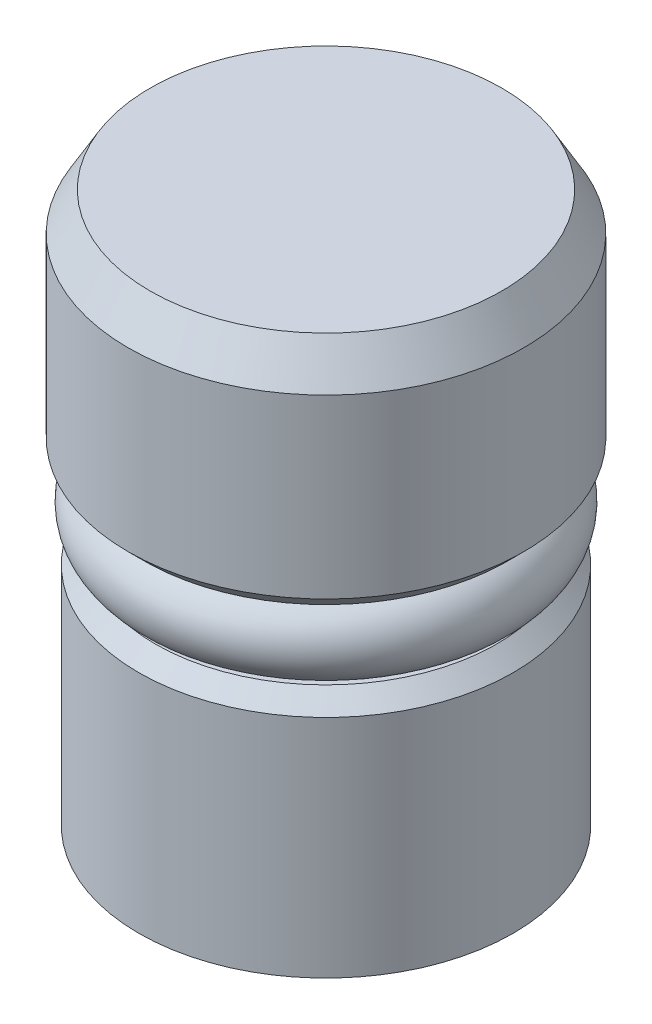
ISO-10303-21;
HEADER;
FILE_DESCRIPTION(('STEP AP214'),'2;1');
FILE_NAME('part.step','',(''),(''),'','','');
FILE_SCHEMA(('AUTOMOTIVE_DESIGN { 1 0 10303 214 1 1 1 1 }'));
ENDSEC;
DATA;
#1=APPLICATION_CONTEXT('core data for automotive mechanical design processes');
#2=APPLICATION_PROTOCOL_DEFINITION('international standard','automotive_design',2000,#1);
#3=PRODUCT_CONTEXT('',#1,'mechanical');
#4=PRODUCT('Part','Part','',(#3));
#5=PRODUCT_RELATED_PRODUCT_CATEGORY('part','',(#4));
#6=PRODUCT_DEFINITION_FORMATION('','',#4);
#7=PRODUCT_DEFINITION_CONTEXT('part definition',#1,'design');
#8=PRODUCT_DEFINITION('design','',#6,#7);
#9=PRODUCT_DEFINITION_SHAPE('','',#8);
#10=(LENGTH_UNIT() NAMED_UNIT(*) SI_UNIT(.MILLI.,.METRE.));
#11=(NAMED_UNIT(*) PLANE_ANGLE_UNIT() SI_UNIT($,.RADIAN.));
#12=(NAMED_UNIT(*) SI_UNIT($,.STERADIAN.) SOLID_ANGLE_UNIT());
#13=UNCERTAINTY_MEASURE_WITH_UNIT(LENGTH_MEASURE(1.E-05),#10,'distance_accuracy_value','');
#14=(GEOMETRIC_REPRESENTATION_CONTEXT(3) GLOBAL_UNCERTAINTY_ASSIGNED_CONTEXT((#13)) GLOBAL_UNIT_ASSIGNED_CONTEXT((#10,
#11,#12)) REPRESENTATION_CONTEXT('',''));
#15=CARTESIAN_POINT('',(0.,0.,0.));
#16=DIRECTION('',(0.,0.,1.));
#17=DIRECTION('',(1.,0.,0.));
#18=AXIS2_PLACEMENT_3D('',#15,#16,#17);
#19=CARTESIAN_POINT('',(0.,0.,0.));
#20=DIRECTION('',(0.,-1.,0.));
#21=DIRECTION('',(0.,0.,-1.));
#22=AXIS2_PLACEMENT_3D('',#19,#20,#21);
#23=PLANE('',#22);
#24=CARTESIAN_POINT('',(0.,0.,0.));
#25=DIRECTION('',(0.,-1.,0.));
#26=DIRECTION('',(0.,0.,-1.));
#27=AXIS2_PLACEMENT_3D('',#24,#25,#26);
#28=CIRCLE('',#27,3.9848917);
#29=CARTESIAN_POINT('',(0.,0.,-3.9848917));
#30=VERTEX_POINT('',#29);
#31=EDGE_CURVE('P0_E36',#30,#30,#28,.T.);
#32=ORIENTED_EDGE('',*,*,#31,.F.);
#33=EDGE_LOOP('',(#32));
#34=FACE_BOUND('',#33,.T.);
#35=CARTESIAN_POINT('',(0.,0.,0.));
#36=DIRECTION('',(0.,-1.,0.));
#37=DIRECTION('',(0.,0.,-1.));
#38=AXIS2_PLACEMENT_3D('',#35,#36,#37);
#39=CIRCLE('',#38,4.318);
#40=CARTESIAN_POINT('',(0.,0.,-4.318));
#41=VERTEX_POINT('',#40);
#42=EDGE_CURVE('P0_E56',#41,#41,#39,.T.);
#43=ORIENTED_EDGE('',*,*,#42,.T.);
#44=EDGE_LOOP('',(#43));
#45=FACE_BOUND('',#44,.T.);
#46=ADVANCED_FACE('P0_F16',(#34,#45),#23,.T.);
#47=CARTESIAN_POINT('',(0.,0.,0.));
#48=DIRECTION('',(0.,-1.,0.));
#49=DIRECTION('',(0.,0.,-1.));
#50=AXIS2_PLACEMENT_3D('',#47,#48,#49);
#51=CYLINDRICAL_SURFACE('',#50,4.318);
#52=CARTESIAN_POINT('',(0.,5.207,0.));
#53=DIRECTION('',(0.,1.,0.));
#54=DIRECTION('',(0.,0.,1.));
#55=AXIS2_PLACEMENT_3D('',#52,#53,#54);
#56=CIRCLE('',#55,4.318);
#57=CARTESIAN_POINT('',(0.,5.207,4.318));
#58=VERTEX_POINT('',#57);
#59=EDGE_CURVE('P0_E59',#58,#58,#56,.F.);
#60=ORIENTED_EDGE('',*,*,#59,.T.);
#61=EDGE_LOOP('',(#60));
#62=FACE_BOUND('',#61,.T.);
#63=ORIENTED_EDGE('',*,*,#42,.F.);
#64=EDGE_LOOP('',(#63));
#65=FACE_BOUND('',#64,.T.);
#66=ADVANCED_FACE('P0_F88',(#62,#65),#51,.T.);
#67=CARTESIAN_POINT('',(4.318,5.588,0.));
#68=DIRECTION('',(0.,1.,0.));
#69=DIRECTION('',(0.,0.,1.));
#70=AXIS2_PLACEMENT_3D('',#67,#68,#69);
#71=PLANE('',#70);
#72=CARTESIAN_POINT('',(0.,5.588,0.));
#73=DIRECTION('',(0.,1.,0.));
#74=DIRECTION('',(0.,0.,1.));
#75=AXIS2_PLACEMENT_3D('',#72,#73,#74);
#76=CIRCLE('',#75,3.937);
#77=CARTESIAN_POINT('',(0.,5.588,3.937));
#78=VERTEX_POINT('',#77);
#79=EDGE_CURVE('P0_E62',#78,#78,#76,.T.);
#80=ORIENTED_EDGE('',*,*,#79,.T.);
#81=EDGE_LOOP('',(#80));
#82=FACE_BOUND('',#81,.T.);
#83=CARTESIAN_POINT('',(0.,5.588,0.));
#84=DIRECTION('',(0.,-1.,0.));
#85=DIRECTION('',(0.,0.,-1.));
#86=AXIS2_PLACEMENT_3D('',#83,#84,#85);
#87=CIRCLE('',#86,2.54);
#88=CARTESIAN_POINT('',(0.,5.588,-2.54));
#89=VERTEX_POINT('',#88);
#90=EDGE_CURVE('P0_E53',#89,#89,#87,.T.);
#91=ORIENTED_EDGE('',*,*,#90,.T.);
#92=EDGE_LOOP('',(#91));
#93=FACE_BOUND('',#92,.T.);
#94=ADVANCED_FACE('P0_F95',(#82,#93),#71,.T.);
#95=CARTESIAN_POINT('',(0.,0.,0.));
#96=DIRECTION('',(0.,-1.,0.));
#97=DIRECTION('',(0.,0.,-1.));
#98=AXIS2_PLACEMENT_3D('',#95,#96,#97);
#99=CYLINDRICAL_SURFACE('',#98,2.54);
#100=CARTESIAN_POINT('',(0.,7.366,0.));
#101=DIRECTION('',(0.,-1.,0.));
#102=DIRECTION('',(0.,0.,-1.));
#103=AXIS2_PLACEMENT_3D('',#100,#101,#102);
#104=CIRCLE('',#103,2.54);
#105=CARTESIAN_POINT('',(0.,7.366,-2.54));
#106=VERTEX_POINT('',#105);
#107=EDGE_CURVE('P0_E50',#106,#106,#104,.T.);
#108=ORIENTED_EDGE('',*,*,#107,.T.);
#109=EDGE_LOOP('',(#108));
#110=FACE_BOUND('',#109,.T.);
#111=ORIENTED_EDGE('',*,*,#90,.F.);
#112=EDGE_LOOP('',(#111));
#113=FACE_BOUND('',#112,.T.);
#114=ADVANCED_FACE('P0_F117',(#110,#113),#99,.T.);
#115=CARTESIAN_POINT('',(2.54,7.366,0.));
#116=DIRECTION('',(0.,-1.,0.));
#117=DIRECTION('',(0.,0.,-1.));
#118=AXIS2_PLACEMENT_3D('',#115,#116,#117);
#119=PLANE('',#118);
#120=CARTESIAN_POINT('',(0.,7.366,0.));
#121=DIRECTION('',(0.,-1.,0.));
#122=DIRECTION('',(0.,0.,-1.));
#123=AXIS2_PLACEMENT_3D('',#120,#121,#122);
#124=CIRCLE('',#123,4.18306250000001);
#125=CARTESIAN_POINT('',(0.,7.366,-4.18306250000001));
#126=VERTEX_POINT('',#125);
#127=EDGE_CURVE('P0_E65',#126,#126,#124,.T.);
#128=ORIENTED_EDGE('',*,*,#127,.T.);
#129=EDGE_LOOP('',(#128));
#130=FACE_BOUND('',#129,.T.);
#131=ORIENTED_EDGE('',*,*,#107,.F.);
#132=EDGE_LOOP('',(#131));
#133=FACE_BOUND('',#132,.T.);
#134=ADVANCED_FACE('P0_F121',(#130,#133),#119,.T.);
#135=CARTESIAN_POINT('',(0.,0.,0.));
#136=DIRECTION('',(0.,-1.,0.));
#137=DIRECTION('',(0.,0.,-1.));
#138=AXIS2_PLACEMENT_3D('',#135,#136,#137);
#139=CYLINDRICAL_SURFACE('',#138,4.5640625);
#140=CARTESIAN_POINT('',(0.,11.820118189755,0.));
#141=DIRECTION('',(0.,1.,0.));
#142=DIRECTION('',(0.,0.,1.));
#143=AXIS2_PLACEMENT_3D('',#140,#141,#142);
#144=CIRCLE('',#143,4.5640625);
#145=CARTESIAN_POINT('',(0.,11.820118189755,4.5640625));
#146=VERTEX_POINT('',#145);
#147=EDGE_CURVE('P0_E23',#146,#146,#144,.F.);
#148=ORIENTED_EDGE('',*,*,#147,.T.);
#149=EDGE_LOOP('',(#148));
#150=FACE_BOUND('',#149,.T.);
#151=CARTESIAN_POINT('',(0.,7.747,0.));
#152=DIRECTION('',(0.,-1.,0.));
#153=DIRECTION('',(0.,0.,-1.));
#154=AXIS2_PLACEMENT_3D('',#151,#152,#153);
#155=CIRCLE('',#154,4.5640625);
#156=CARTESIAN_POINT('',(0.,7.747,-4.5640625));
#157=VERTEX_POINT('',#156);
#158=EDGE_CURVE('P0_E68',#157,#157,#155,.F.);
#159=ORIENTED_EDGE('',*,*,#158,.T.);
#160=EDGE_LOOP('',(#159));
#161=FACE_BOUND('',#160,.T.);
#162=ADVANCED_FACE('P0_F73',(#150,#161),#139,.T.);
#163=CARTESIAN_POINT('',(4.5640625,12.7,0.));
#164=DIRECTION('',(0.,1.,0.));
#165=DIRECTION('',(0.,0.,1.));
#166=AXIS2_PLACEMENT_3D('',#163,#164,#165);
#167=PLANE('',#166);
#168=CARTESIAN_POINT('',(0.,12.7,0.));
#169=DIRECTION('',(0.,1.,0.));
#170=DIRECTION('',(0.,0.,1.));
#171=AXIS2_PLACEMENT_3D('',#168,#169,#170);
#172=CIRCLE('',#171,4.05606249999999);
#173=CARTESIAN_POINT('',(0.,12.7,4.05606249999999));
#174=VERTEX_POINT('',#173);
#175=EDGE_CURVE('P0_E11',#174,#174,#172,.T.);
#176=ORIENTED_EDGE('',*,*,#175,.T.);
#177=EDGE_LOOP('',(#176));
#178=FACE_BOUND('',#177,.T.);
#179=ADVANCED_FACE('P0_F133',(#178),#167,.T.);
#180=CARTESIAN_POINT('',(0.,2.4892,0.));
#181=DIRECTION('',(0.,1.,0.));
#182=DIRECTION('',(0.,0.,1.));
#183=AXIS2_PLACEMENT_3D('',#180,#181,#182);
#184=PLANE('',#183);
#185=CARTESIAN_POINT('',(0.,2.4892,0.));
#186=DIRECTION('',(0.,-1.,0.));
#187=DIRECTION('',(0.,0.,-1.));
#188=AXIS2_PLACEMENT_3D('',#185,#186,#187);
#189=CIRCLE('',#188,1.35255);
#190=CARTESIAN_POINT('',(0.,2.4892,-1.35255));
#191=VERTEX_POINT('',#190);
#192=EDGE_CURVE('P0_E37',#191,#191,#189,.T.);
#193=ORIENTED_EDGE('',*,*,#192,.F.);
#194=EDGE_LOOP('',(#193));
#195=FACE_BOUND('',#194,.T.);
#196=CARTESIAN_POINT('',(0.,2.4892,0.));
#197=DIRECTION('',(0.,-1.,0.));
#198=DIRECTION('',(0.,0.,-1.));
#199=AXIS2_PLACEMENT_3D('',#196,#197,#198);
#200=CIRCLE('',#199,1.89865);
#201=CARTESIAN_POINT('',(0.,2.4892,-1.89865));
#202=VERTEX_POINT('',#201);
#203=EDGE_CURVE('P0_E47',#202,#202,#200,.T.);
#204=ORIENTED_EDGE('',*,*,#203,.T.);
#205=EDGE_LOOP('',(#204));
#206=FACE_BOUND('',#205,.T.);
#207=ADVANCED_FACE('P0_F136',(#195,#206),#184,.F.);
#208=CARTESIAN_POINT('',(0.,0.,0.));
#209=DIRECTION('',(0.,-1.,0.));
#210=DIRECTION('',(0.,0.,-1.));
#211=AXIS2_PLACEMENT_3D('',#208,#209,#210);
#212=CYLINDRICAL_SURFACE('',#211,1.89865);
#213=ORIENTED_EDGE('',*,*,#203,.F.);
#214=EDGE_LOOP('',(#213));
#215=FACE_BOUND('',#214,.T.);
#216=CARTESIAN_POINT('',(0.,2.39994654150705,0.));
#217=DIRECTION('',(0.,-1.,0.));
#218=DIRECTION('',(0.,0.,-1.));
#219=AXIS2_PLACEMENT_3D('',#216,#217,#218);
#220=CIRCLE('',#219,1.89865);
#221=CARTESIAN_POINT('',(0.,2.39994654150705,-1.89865));
#222=VERTEX_POINT('',#221);
#223=EDGE_CURVE('P0_E40',#222,#222,#220,.T.);
#224=ORIENTED_EDGE('',*,*,#223,.T.);
#225=EDGE_LOOP('',(#224));
#226=FACE_BOUND('',#225,.T.);
#227=ADVANCED_FACE('P0_F140',(#215,#226),#212,.F.);
#228=CARTESIAN_POINT('',(0.,0.,0.));
#229=DIRECTION('',(0.,-1.,0.));
#230=DIRECTION('',(0.,0.,-1.));
#231=AXIS2_PLACEMENT_3D('',#228,#229,#230);
#232=CONICAL_SURFACE('',#231,3.9848917,0.715584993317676);
#233=ORIENTED_EDGE('',*,*,#223,.F.);
#234=EDGE_LOOP('',(#233));
#235=FACE_BOUND('',#234,.T.);
#236=ORIENTED_EDGE('',*,*,#31,.T.);
#237=EDGE_LOOP('',(#236));
#238=FACE_BOUND('',#237,.T.);
#239=ADVANCED_FACE('P0_F30',(#235,#238),#232,.F.);
#240=CARTESIAN_POINT('',(0.,6.2992,0.));
#241=DIRECTION('',(0.,-1.,0.));
#242=DIRECTION('',(0.,0.,-1.));
#243=AXIS2_PLACEMENT_3D('',#240,#241,#242);
#244=CONICAL_SURFACE('',#243,1.35255,1.02974425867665);
#245=CARTESIAN_POINT('',(0.,7.11189403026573,0.));
#246=VERTEX_POINT('',#245);
#247=VERTEX_LOOP('',#246);
#248=FACE_BOUND('',#247,.T.);
#249=CARTESIAN_POINT('',(0.,6.2992,0.));
#250=DIRECTION('',(0.,-1.,0.));
#251=DIRECTION('',(0.,0.,-1.));
#252=AXIS2_PLACEMENT_3D('',#249,#250,#251);
#253=CIRCLE('',#252,1.35255);
#254=CARTESIAN_POINT('',(0.,6.2992,-1.35255));
#255=VERTEX_POINT('',#254);
#256=EDGE_CURVE('P0_E34',#255,#255,#253,.T.);
#257=ORIENTED_EDGE('',*,*,#256,.T.);
#258=EDGE_LOOP('',(#257));
#259=FACE_BOUND('',#258,.T.);
#260=ADVANCED_FACE('P0_F26',(#248,#259),#244,.F.);
#261=CARTESIAN_POINT('',(0.,2.4892,0.));
#262=DIRECTION('',(0.,-1.,0.));
#263=DIRECTION('',(0.,0.,-1.));
#264=AXIS2_PLACEMENT_3D('',#261,#262,#263);
#265=CYLINDRICAL_SURFACE('',#264,1.35255);
#266=ORIENTED_EDGE('',*,*,#256,.F.);
#267=EDGE_LOOP('',(#266));
#268=FACE_BOUND('',#267,.T.);
#269=ORIENTED_EDGE('',*,*,#192,.T.);
#270=EDGE_LOOP('',(#269));
#271=FACE_BOUND('',#270,.T.);
#272=ADVANCED_FACE('P0_F29',(#268,#271),#265,.F.);
#273=CARTESIAN_POINT('',(0.,5.207,0.));
#274=DIRECTION('',(0.,-1.,0.));
#275=DIRECTION('',(0.,0.,-1.));
#276=AXIS2_PLACEMENT_3D('',#273,#274,#275);
#277=CONICAL_SURFACE('',#276,4.318,0.785398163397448);
#278=ORIENTED_EDGE('',*,*,#79,.F.);
#279=EDGE_LOOP('',(#278));
#280=FACE_BOUND('',#279,.T.);
#281=ORIENTED_EDGE('',*,*,#59,.F.);
#282=EDGE_LOOP('',(#281));
#283=FACE_BOUND('',#282,.T.);
#284=ADVANCED_FACE('P0_F84',(#280,#283),#277,.T.);
#285=CARTESIAN_POINT('',(0.,7.366,0.));
#286=DIRECTION('',(0.,1.,0.));
#287=DIRECTION('',(0.,0.,1.));
#288=AXIS2_PLACEMENT_3D('',#285,#286,#287);
#289=CONICAL_SURFACE('',#288,4.18306250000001,0.785398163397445);
#290=ORIENTED_EDGE('',*,*,#158,.F.);
#291=EDGE_LOOP('',(#290));
#292=FACE_BOUND('',#291,.T.);
#293=ORIENTED_EDGE('',*,*,#127,.F.);
#294=EDGE_LOOP('',(#293));
#295=FACE_BOUND('',#294,.T.);
#296=ADVANCED_FACE('P0_F77',(#292,#295),#289,.T.);
#297=CARTESIAN_POINT('',(0.,11.820118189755,0.));
#298=DIRECTION('',(0.,-1.,0.));
#299=DIRECTION('',(0.,0.,-1.));
#300=AXIS2_PLACEMENT_3D('',#297,#298,#299);
#301=CONICAL_SURFACE('',#300,4.5640625,0.5235987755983);
#302=ORIENTED_EDGE('',*,*,#175,.F.);
#303=EDGE_LOOP('',(#302));
#304=FACE_BOUND('',#303,.T.);
#305=ORIENTED_EDGE('',*,*,#147,.F.);
#306=EDGE_LOOP('',(#305));
#307=FACE_BOUND('',#306,.T.);
#308=ADVANCED_FACE('P0_F18',(#304,#307),#301,.T.);
#309=CLOSED_SHELL('',(#46,#66,#94,#114,#134,#162,#179,#207,#227,#239,#260,#272,#284,#296,#308));
#310=MANIFOLD_SOLID_BREP('P0_B1',#309);
#311=CARTESIAN_POINT('',(0.,8.03642213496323,0.));
#312=DIRECTION('',(0.,1.,0.));
#313=DIRECTION('',(1.,0.,0.));
#314=AXIS2_PLACEMENT_3D('',#311,#312,#313);
#315=PLANE('',#314);
#316=CARTESIAN_POINT('',(0.,8.03642213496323,0.));
#317=DIRECTION('',(0.,1.,0.));
#318=DIRECTION('',(1.,0.,0.));
#319=AXIS2_PLACEMENT_3D('',#316,#317,#318);
#320=CIRCLE('',#319,1.7526);
#321=CARTESIAN_POINT('',(1.7526,8.03642213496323,0.));
#322=VERTEX_POINT('',#321);
#323=EDGE_CURVE('P1_E11',#322,#322,#320,.T.);
#324=ORIENTED_EDGE('',*,*,#323,.T.);
#325=EDGE_LOOP('',(#324));
#326=FACE_BOUND('',#325,.T.);
#327=ADVANCED_FACE('P1_F16',(#326),#315,.T.);
#328=CARTESIAN_POINT('',(0.,8.03642213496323,0.));
#329=DIRECTION('',(0.,1.,0.));
#330=DIRECTION('',(1.,0.,0.));
#331=AXIS2_PLACEMENT_3D('',#328,#329,#330);
#332=CYLINDRICAL_SURFACE('',#331,1.7526);
#333=CARTESIAN_POINT('',(0.,2.56795784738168,0.));
#334=DIRECTION('',(0.,1.,0.));
#335=DIRECTION('',(1.,0.,0.));
#336=AXIS2_PLACEMENT_3D('',#333,#334,#335);
#337=CIRCLE('',#336,1.7526);
#338=CARTESIAN_POINT('',(1.7526,2.56795784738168,0.));
#339=VERTEX_POINT('',#338);
#340=EDGE_CURVE('P1_E23',#339,#339,#337,.T.);
#341=ORIENTED_EDGE('',*,*,#340,.T.);
#342=EDGE_LOOP('',(#341));
#343=FACE_BOUND('',#342,.T.);
#344=ORIENTED_EDGE('',*,*,#323,.F.);
#345=EDGE_LOOP('',(#344));
#346=FACE_BOUND('',#345,.T.);
#347=ADVANCED_FACE('P1_F127',(#343,#346),#332,.T.);
#348=CARTESIAN_POINT('',(0.,2.56795784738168,0.));
#349=DIRECTION('',(0.,-1.,0.));
#350=DIRECTION('',(-1.,0.,0.));
#351=AXIS2_PLACEMENT_3D('',#348,#349,#350);
#352=CONICAL_SURFACE('',#351,1.7526,0.715584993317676);
#353=CARTESIAN_POINT('',(0.,0.0989221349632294,0.));
#354=DIRECTION('',(0.,1.,0.));
#355=DIRECTION('',(1.,0.,0.));
#356=AXIS2_PLACEMENT_3D('',#353,#354,#355);
#357=CIRCLE('',#356,3.8989);
#358=CARTESIAN_POINT('',(3.8989,0.0989221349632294,0.));
#359=VERTEX_POINT('',#358);
#360=EDGE_CURVE('P1_E117',#359,#359,#357,.T.);
#361=ORIENTED_EDGE('',*,*,#360,.T.);
#362=EDGE_LOOP('',(#361));
#363=FACE_BOUND('',#362,.T.);
#364=ORIENTED_EDGE('',*,*,#340,.F.);
#365=EDGE_LOOP('',(#364));
#366=FACE_BOUND('',#365,.T.);
#367=ADVANCED_FACE('P1_F130',(#363,#366),#352,.T.);
#368=CARTESIAN_POINT('',(0.,0.0989221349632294,3.8989));
#369=DIRECTION('',(0.,-1.,0.));
#370=DIRECTION('',(-1.,0.,0.));
#371=AXIS2_PLACEMENT_3D('',#368,#369,#370);
#372=PLANE('',#371);
#373=DIRECTION('',(0.866025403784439,0.,0.5));
#374=VECTOR('',#373,1.);
#375=CARTESIAN_POINT('',(0.,0.0989221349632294,-1.14384635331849));
#376=LINE('',#375,#374);
#377=CARTESIAN_POINT('',(0.,0.0989221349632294,-1.14384635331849));
#378=VERTEX_POINT('',#377);
#379=CARTESIAN_POINT('',(0.9906,0.0989221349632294,-0.571923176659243));
#380=VERTEX_POINT('',#379);
#381=EDGE_CURVE('P1_E30',#378,#380,#376,.T.);
#382=ORIENTED_EDGE('',*,*,#381,.F.);
#383=DIRECTION('',(0.866025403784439,0.,-0.5));
#384=VECTOR('',#383,1.);
#385=CARTESIAN_POINT('',(-0.9906,0.0989221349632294,-0.571923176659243));
#386=LINE('',#385,#384);
#387=CARTESIAN_POINT('',(-0.9906,0.0989221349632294,-0.571923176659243));
#388=VERTEX_POINT('',#387);
#389=EDGE_CURVE('P1_E113',#388,#378,#386,.T.);
#390=ORIENTED_EDGE('',*,*,#389,.F.);
#391=DIRECTION('',(0.,0.,-1.));
#392=VECTOR('',#391,1.);
#393=CARTESIAN_POINT('',(-0.9906,0.0989221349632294,0.571923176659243));
#394=LINE('',#393,#392);
#395=CARTESIAN_POINT('',(-0.9906,0.0989221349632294,0.571923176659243));
#396=VERTEX_POINT('',#395);
#397=EDGE_CURVE('P1_E111',#396,#388,#394,.T.);
#398=ORIENTED_EDGE('',*,*,#397,.F.);
#399=DIRECTION('',(-0.866025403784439,0.,-0.5));
#400=VECTOR('',#399,1.);
#401=CARTESIAN_POINT('',(0.,0.0989221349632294,1.14384635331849));
#402=LINE('',#401,#400);
#403=CARTESIAN_POINT('',(0.,0.0989221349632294,1.14384635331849));
#404=VERTEX_POINT('',#403);
#405=EDGE_CURVE('P1_E78',#404,#396,#402,.T.);
#406=ORIENTED_EDGE('',*,*,#405,.F.);
#407=DIRECTION('',(-0.866025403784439,0.,0.5));
#408=VECTOR('',#407,1.);
#409=CARTESIAN_POINT('',(0.9906,0.0989221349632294,0.571923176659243));
#410=LINE('',#409,#408);
#411=CARTESIAN_POINT('',(0.9906,0.0989221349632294,0.571923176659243));
#412=VERTEX_POINT('',#411);
#413=EDGE_CURVE('P1_E107',#412,#404,#410,.T.);
#414=ORIENTED_EDGE('',*,*,#413,.F.);
#415=DIRECTION('',(0.,0.,1.));
#416=VECTOR('',#415,1.);
#417=CARTESIAN_POINT('',(0.9906,0.0989221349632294,-0.571923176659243));
#418=LINE('',#417,#416);
#419=EDGE_CURVE('P1_E104',#380,#412,#418,.T.);
#420=ORIENTED_EDGE('',*,*,#419,.F.);
#421=EDGE_LOOP('',(#382,#390,#398,#406,#414,#420));
#422=FACE_BOUND('',#421,.T.);
#423=ORIENTED_EDGE('',*,*,#360,.F.);
#424=EDGE_LOOP('',(#423));
#425=FACE_BOUND('',#424,.T.);
#426=ADVANCED_FACE('P1_F132',(#422,#425),#372,.T.);
#427=CARTESIAN_POINT('',(0.,2.13092213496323,-1.14384635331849));
#428=DIRECTION('',(0.5,0.,-0.866025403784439));
#429=DIRECTION('',(-0.866025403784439,0.,-0.5));
#430=AXIS2_PLACEMENT_3D('',#427,#428,#429);
#431=PLANE('',#430);
#432=ORIENTED_EDGE('',*,*,#381,.T.);
#433=DIRECTION('',(0.,-1.,0.));
#434=VECTOR('',#433,1.);
#435=CARTESIAN_POINT('',(0.9906,2.13092213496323,-0.571923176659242));
#436=LINE('',#435,#434);
#437=CARTESIAN_POINT('',(0.9906,2.13092213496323,-0.571923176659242));
#438=VERTEX_POINT('',#437);
#439=EDGE_CURVE('P1_E60',#438,#380,#436,.T.);
#440=ORIENTED_EDGE('',*,*,#439,.F.);
#441=DIRECTION('',(0.866025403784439,0.,0.5));
#442=VECTOR('',#441,1.);
#443=CARTESIAN_POINT('',(0.,2.13092213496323,-1.14384635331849));
#444=LINE('',#443,#442);
#445=CARTESIAN_POINT('',(0.,2.13092213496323,-1.14384635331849));
#446=VERTEX_POINT('',#445);
#447=EDGE_CURVE('P1_E115',#446,#438,#444,.T.);
#448=ORIENTED_EDGE('',*,*,#447,.F.);
#449=DIRECTION('',(0.,-1.,0.));
#450=VECTOR('',#449,1.);
#451=CARTESIAN_POINT('',(0.,2.13092213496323,-1.14384635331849));
#452=LINE('',#451,#450);
#453=EDGE_CURVE('P1_E38',#446,#378,#452,.T.);
#454=ORIENTED_EDGE('',*,*,#453,.T.);
#455=EDGE_LOOP('',(#432,#440,#448,#454));
#456=FACE_BOUND('',#455,.T.);
#457=ADVANCED_FACE('P1_F141',(#456),#431,.F.);
#458=CARTESIAN_POINT('',(-0.9906,2.13092213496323,-0.571923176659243));
#459=DIRECTION('',(-0.5,0.,-0.866025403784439));
#460=DIRECTION('',(-0.866025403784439,0.,0.5));
#461=AXIS2_PLACEMENT_3D('',#458,#459,#460);
#462=PLANE('',#461);
#463=ORIENTED_EDGE('',*,*,#389,.T.);
#464=ORIENTED_EDGE('',*,*,#453,.F.);
#465=DIRECTION('',(0.866025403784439,0.,-0.5));
#466=VECTOR('',#465,1.);
#467=CARTESIAN_POINT('',(-0.9906,2.13092213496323,-0.571923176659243));
#468=LINE('',#467,#466);
#469=CARTESIAN_POINT('',(-0.9906,2.13092213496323,-0.571923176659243));
#470=VERTEX_POINT('',#469);
#471=EDGE_CURVE('P1_E90',#470,#446,#468,.T.);
#472=ORIENTED_EDGE('',*,*,#471,.F.);
#473=DIRECTION('',(0.,-1.,0.));
#474=VECTOR('',#473,1.);
#475=CARTESIAN_POINT('',(-0.9906,2.13092213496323,-0.571923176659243));
#476=LINE('',#475,#474);
#477=EDGE_CURVE('P1_E82',#470,#388,#476,.T.);
#478=ORIENTED_EDGE('',*,*,#477,.T.);
#479=EDGE_LOOP('',(#463,#464,#472,#478));
#480=FACE_BOUND('',#479,.T.);
#481=ADVANCED_FACE('P1_F180',(#480),#462,.F.);
#482=CARTESIAN_POINT('',(-0.9906,2.13092213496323,0.571923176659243));
#483=DIRECTION('',(-1.,0.,0.));
#484=DIRECTION('',(0.,1.,0.));
#485=AXIS2_PLACEMENT_3D('',#482,#483,#484);
#486=PLANE('',#485);
#487=ORIENTED_EDGE('',*,*,#397,.T.);
#488=ORIENTED_EDGE('',*,*,#477,.F.);
#489=DIRECTION('',(0.,0.,-1.));
#490=VECTOR('',#489,1.);
#491=CARTESIAN_POINT('',(-0.9906,2.13092213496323,0.571923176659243));
#492=LINE('',#491,#490);
#493=CARTESIAN_POINT('',(-0.9906,2.13092213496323,0.571923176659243));
#494=VERTEX_POINT('',#493);
#495=EDGE_CURVE('P1_E86',#494,#470,#492,.T.);
#496=ORIENTED_EDGE('',*,*,#495,.F.);
#497=DIRECTION('',(0.,-1.,0.));
#498=VECTOR('',#497,1.);
#499=CARTESIAN_POINT('',(-0.9906,2.13092213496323,0.571923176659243));
#500=LINE('',#499,#498);
#501=EDGE_CURVE('P1_E71',#494,#396,#500,.T.);
#502=ORIENTED_EDGE('',*,*,#501,.T.);
#503=EDGE_LOOP('',(#487,#488,#496,#502));
#504=FACE_BOUND('',#503,.T.);
#505=ADVANCED_FACE('P1_F87',(#504),#486,.F.);
#506=CARTESIAN_POINT('',(0.,2.13092213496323,1.14384635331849));
#507=DIRECTION('',(-0.5,0.,0.866025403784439));
#508=DIRECTION('',(0.866025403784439,0.,0.5));
#509=AXIS2_PLACEMENT_3D('',#506,#507,#508);
#510=PLANE('',#509);
#511=ORIENTED_EDGE('',*,*,#405,.T.);
#512=ORIENTED_EDGE('',*,*,#501,.F.);
#513=DIRECTION('',(-0.866025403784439,0.,-0.5));
#514=VECTOR('',#513,1.);
#515=CARTESIAN_POINT('',(0.,2.13092213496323,1.14384635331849));
#516=LINE('',#515,#514);
#517=CARTESIAN_POINT('',(0.,2.13092213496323,1.14384635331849));
#518=VERTEX_POINT('',#517);
#519=EDGE_CURVE('P1_E75',#518,#494,#516,.T.);
#520=ORIENTED_EDGE('',*,*,#519,.F.);
#521=DIRECTION('',(0.,-1.,0.));
#522=VECTOR('',#521,1.);
#523=CARTESIAN_POINT('',(0.,2.13092213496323,1.14384635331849));
#524=LINE('',#523,#522);
#525=EDGE_CURVE('P1_E83',#518,#404,#524,.T.);
#526=ORIENTED_EDGE('',*,*,#525,.T.);
#527=EDGE_LOOP('',(#511,#512,#520,#526));
#528=FACE_BOUND('',#527,.T.);
#529=ADVANCED_FACE('P1_F73',(#528),#510,.F.);
#530=CARTESIAN_POINT('',(0.9906,2.13092213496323,0.571923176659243));
#531=DIRECTION('',(0.5,0.,0.866025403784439));
#532=DIRECTION('',(0.866025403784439,0.,-0.5));
#533=AXIS2_PLACEMENT_3D('',#530,#531,#532);
#534=PLANE('',#533);
#535=ORIENTED_EDGE('',*,*,#413,.T.);
#536=ORIENTED_EDGE('',*,*,#525,.F.);
#537=DIRECTION('',(-0.866025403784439,0.,0.5));
#538=VECTOR('',#537,1.);
#539=CARTESIAN_POINT('',(0.9906,2.13092213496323,0.571923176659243));
#540=LINE('',#539,#538);
#541=CARTESIAN_POINT('',(0.9906,2.13092213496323,0.571923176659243));
#542=VERTEX_POINT('',#541);
#543=EDGE_CURVE('P1_E96',#542,#518,#540,.T.);
#544=ORIENTED_EDGE('',*,*,#543,.F.);
#545=DIRECTION('',(0.,-1.,0.));
#546=VECTOR('',#545,1.);
#547=CARTESIAN_POINT('',(0.9906,2.13092213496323,0.571923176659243));
#548=LINE('',#547,#546);
#549=EDGE_CURVE('P1_E120',#542,#412,#548,.T.);
#550=ORIENTED_EDGE('',*,*,#549,.T.);
#551=EDGE_LOOP('',(#535,#536,#544,#550));
#552=FACE_BOUND('',#551,.T.);
#553=ADVANCED_FACE('P1_F201',(#552),#534,.F.);
#554=CARTESIAN_POINT('',(0.9906,2.13092213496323,-0.571923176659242));
#555=DIRECTION('',(1.,0.,0.));
#556=DIRECTION('',(0.,-1.,0.));
#557=AXIS2_PLACEMENT_3D('',#554,#555,#556);
#558=PLANE('',#557);
#559=ORIENTED_EDGE('',*,*,#419,.T.);
#560=ORIENTED_EDGE('',*,*,#549,.F.);
#561=DIRECTION('',(0.,0.,1.));
#562=VECTOR('',#561,1.);
#563=CARTESIAN_POINT('',(0.9906,2.13092213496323,-0.571923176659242));
#564=LINE('',#563,#562);
#565=EDGE_CURVE('P1_E98',#438,#542,#564,.T.);
#566=ORIENTED_EDGE('',*,*,#565,.F.);
#567=ORIENTED_EDGE('',*,*,#439,.T.);
#568=EDGE_LOOP('',(#559,#560,#566,#567));
#569=FACE_BOUND('',#568,.T.);
#570=ADVANCED_FACE('P1_F209',(#569),#558,.F.);
#571=CARTESIAN_POINT('',(0.,2.13092213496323,-1.14384635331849));
#572=DIRECTION('',(0.,1.,0.));
#573=DIRECTION('',(1.,0.,0.));
#574=AXIS2_PLACEMENT_3D('',#571,#572,#573);
#575=PLANE('',#574);
#576=ORIENTED_EDGE('',*,*,#447,.T.);
#577=ORIENTED_EDGE('',*,*,#565,.T.);
#578=ORIENTED_EDGE('',*,*,#543,.T.);
#579=ORIENTED_EDGE('',*,*,#519,.T.);
#580=ORIENTED_EDGE('',*,*,#495,.T.);
#581=ORIENTED_EDGE('',*,*,#471,.T.);
#582=EDGE_LOOP('',(#576,#577,#578,#579,#580,#581));
#583=FACE_BOUND('',#582,.T.);
#584=ADVANCED_FACE('P1_F93',(#583),#575,.F.);
#585=CLOSED_SHELL('',(#327,#347,#367,#426,#457,#481,#505,#529,#553,#570,#584));
#586=MANIFOLD_SOLID_BREP('P1_B1',#585);
#587=CARTESIAN_POINT('',(0.,6.477,0.));
#588=DIRECTION('',(0.,-1.,0.));
#589=DIRECTION('',(0.,0.,-1.));
#590=AXIS2_PLACEMENT_3D('',#587,#588,#589);
#591=TOROIDAL_SURFACE('',#590,3.5306,0.889);
#592=CARTESIAN_POINT('',(0.,6.477,-4.4196));
#593=VERTEX_POINT('',#592);
#594=VERTEX_LOOP('',#593);
#595=FACE_BOUND('',#594,.T.);
#596=ADVANCED_FACE('P2_F11',(#595),#591,.T.);
#597=CLOSED_SHELL('',(#596));
#598=MANIFOLD_SOLID_BREP('P2_B1',#597);
#599=ADVANCED_BREP_SHAPE_REPRESENTATION('',(#18,#310,#586,#598),#14);
#600=SHAPE_DEFINITION_REPRESENTATION(#9,#599);
ENDSEC;
END-ISO-10303-21;
